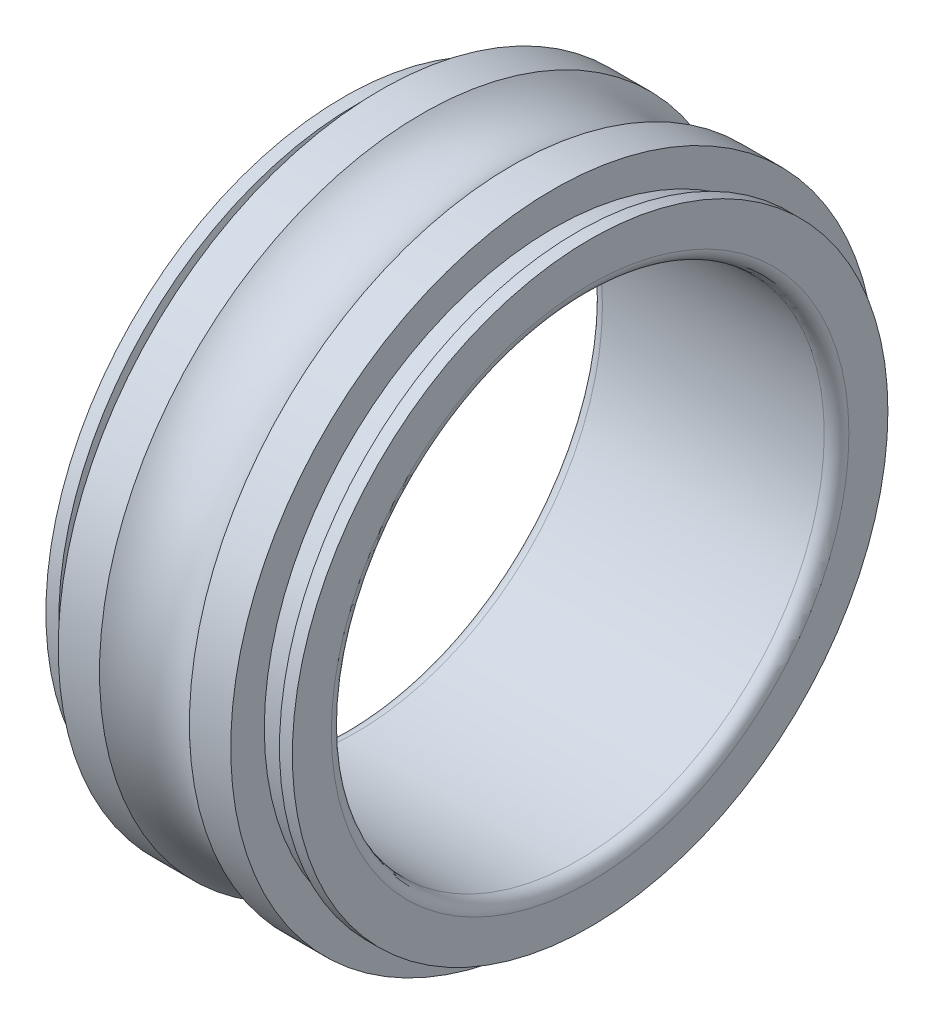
ISO-10303-21;
HEADER;
FILE_DESCRIPTION(('STEP AP214'),'2;1');
FILE_NAME('part.step','',(''),(''),'','','');
FILE_SCHEMA(('AUTOMOTIVE_DESIGN { 1 0 10303 214 1 1 1 1 }'));
ENDSEC;
DATA;
#1=APPLICATION_CONTEXT('core data for automotive mechanical design processes');
#2=APPLICATION_PROTOCOL_DEFINITION('international standard','automotive_design',2000,#1);
#3=PRODUCT_CONTEXT('',#1,'mechanical');
#4=PRODUCT('Part','Part','',(#3));
#5=PRODUCT_RELATED_PRODUCT_CATEGORY('part','',(#4));
#6=PRODUCT_DEFINITION_FORMATION('','',#4);
#7=PRODUCT_DEFINITION_CONTEXT('part definition',#1,'design');
#8=PRODUCT_DEFINITION('design','',#6,#7);
#9=PRODUCT_DEFINITION_SHAPE('','',#8);
#10=(LENGTH_UNIT() NAMED_UNIT(*) SI_UNIT(.MILLI.,.METRE.));
#11=(NAMED_UNIT(*) PLANE_ANGLE_UNIT() SI_UNIT($,.RADIAN.));
#12=(NAMED_UNIT(*) SI_UNIT($,.STERADIAN.) SOLID_ANGLE_UNIT());
#13=UNCERTAINTY_MEASURE_WITH_UNIT(LENGTH_MEASURE(1.E-05),#10,'distance_accuracy_value','');
#14=(GEOMETRIC_REPRESENTATION_CONTEXT(3) GLOBAL_UNCERTAINTY_ASSIGNED_CONTEXT((#13)) GLOBAL_UNIT_ASSIGNED_CONTEXT((#10,
#11,#12)) REPRESENTATION_CONTEXT('',''));
#15=CARTESIAN_POINT('',(0.,0.,0.));
#16=DIRECTION('',(0.,0.,1.));
#17=DIRECTION('',(1.,0.,0.));
#18=AXIS2_PLACEMENT_3D('',#15,#16,#17);
#19=CARTESIAN_POINT('',(0.,7.25,0.));
#20=DIRECTION('',(-1.,0.,0.));
#21=DIRECTION('',(0.,0.,1.));
#22=AXIS2_PLACEMENT_3D('',#19,#20,#21);
#23=PLANE('',#22);
#24=CARTESIAN_POINT('',(0.,0.,0.));
#25=DIRECTION('',(1.,0.,0.));
#26=DIRECTION('',(0.,0.,-1.));
#27=AXIS2_PLACEMENT_3D('',#24,#25,#26);
#28=CIRCLE('',#27,6.3);
#29=CARTESIAN_POINT('',(0.,0.,-6.3));
#30=VERTEX_POINT('',#29);
#31=EDGE_CURVE('E67',#30,#30,#28,.T.);
#32=ORIENTED_EDGE('',*,*,#31,.T.);
#33=EDGE_LOOP('',(#32));
#34=FACE_BOUND('',#33,.T.);
#35=CARTESIAN_POINT('',(0.,0.,0.));
#36=DIRECTION('',(1.,0.,0.));
#37=DIRECTION('',(0.,0.,-1.));
#38=AXIS2_PLACEMENT_3D('',#35,#36,#37);
#39=CIRCLE('',#38,7.25);
#40=CARTESIAN_POINT('',(0.,0.,-7.25));
#41=VERTEX_POINT('',#40);
#42=EDGE_CURVE('E64',#41,#41,#39,.T.);
#43=ORIENTED_EDGE('',*,*,#42,.F.);
#44=EDGE_LOOP('',(#43));
#45=FACE_BOUND('',#44,.T.);
#46=ADVANCED_FACE('F14',(#34,#45),#23,.T.);
#47=CARTESIAN_POINT('',(0.299999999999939,0.,0.));
#48=DIRECTION('',(1.,0.,0.));
#49=DIRECTION('',(0.,0.,-1.));
#50=AXIS2_PLACEMENT_3D('',#47,#48,#49);
#51=TOROIDAL_SURFACE('',#50,6.3,0.299999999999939);
#52=CARTESIAN_POINT('',(0.3,0.,0.));
#53=DIRECTION('',(1.,0.,0.));
#54=DIRECTION('',(0.,0.,-1.));
#55=AXIS2_PLACEMENT_3D('',#52,#53,#54);
#56=CIRCLE('',#55,6.);
#57=CARTESIAN_POINT('',(0.3,0.,-6.));
#58=VERTEX_POINT('',#57);
#59=EDGE_CURVE('E61',#58,#58,#56,.T.);
#60=ORIENTED_EDGE('',*,*,#59,.T.);
#61=EDGE_LOOP('',(#60));
#62=FACE_BOUND('',#61,.T.);
#63=ORIENTED_EDGE('',*,*,#31,.F.);
#64=EDGE_LOOP('',(#63));
#65=FACE_BOUND('',#64,.T.);
#66=ADVANCED_FACE('F73',(#62,#65),#51,.T.);
#67=CARTESIAN_POINT('',(6.,0.,0.));
#68=DIRECTION('',(1.,0.,0.));
#69=DIRECTION('',(0.,0.,-1.));
#70=AXIS2_PLACEMENT_3D('',#67,#68,#69);
#71=CYLINDRICAL_SURFACE('',#70,6.);
#72=CARTESIAN_POINT('',(5.7,0.,0.));
#73=DIRECTION('',(1.,0.,0.));
#74=DIRECTION('',(0.,0.,-1.));
#75=AXIS2_PLACEMENT_3D('',#72,#73,#74);
#76=CIRCLE('',#75,6.);
#77=CARTESIAN_POINT('',(5.7,0.,-6.));
#78=VERTEX_POINT('',#77);
#79=EDGE_CURVE('E58',#78,#78,#76,.T.);
#80=ORIENTED_EDGE('',*,*,#79,.T.);
#81=EDGE_LOOP('',(#80));
#82=FACE_BOUND('',#81,.T.);
#83=ORIENTED_EDGE('',*,*,#59,.F.);
#84=EDGE_LOOP('',(#83));
#85=FACE_BOUND('',#84,.T.);
#86=ADVANCED_FACE('F75',(#82,#85),#71,.F.);
#87=CARTESIAN_POINT('',(5.70000000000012,0.,0.));
#88=DIRECTION('',(1.,0.,0.));
#89=DIRECTION('',(0.,0.,-1.));
#90=AXIS2_PLACEMENT_3D('',#87,#88,#89);
#91=TOROIDAL_SURFACE('',#90,6.29999999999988,0.299999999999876);
#92=CARTESIAN_POINT('',(6.,0.,0.));
#93=DIRECTION('',(1.,0.,0.));
#94=DIRECTION('',(0.,0.,-1.));
#95=AXIS2_PLACEMENT_3D('',#92,#93,#94);
#96=CIRCLE('',#95,6.29999999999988);
#97=CARTESIAN_POINT('',(6.,0.,-6.29999999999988));
#98=VERTEX_POINT('',#97);
#99=EDGE_CURVE('E55',#98,#98,#96,.T.);
#100=ORIENTED_EDGE('',*,*,#99,.T.);
#101=EDGE_LOOP('',(#100));
#102=FACE_BOUND('',#101,.T.);
#103=ORIENTED_EDGE('',*,*,#79,.F.);
#104=EDGE_LOOP('',(#103));
#105=FACE_BOUND('',#104,.T.);
#106=ADVANCED_FACE('F83',(#102,#105),#91,.T.);
#107=CARTESIAN_POINT('',(6.,6.3,0.));
#108=DIRECTION('',(1.,0.,0.));
#109=DIRECTION('',(0.,0.,-1.));
#110=AXIS2_PLACEMENT_3D('',#107,#108,#109);
#111=PLANE('',#110);
#112=CARTESIAN_POINT('',(6.,0.,0.));
#113=DIRECTION('',(1.,0.,0.));
#114=DIRECTION('',(0.,0.,-1.));
#115=AXIS2_PLACEMENT_3D('',#112,#113,#114);
#116=CIRCLE('',#115,7.25);
#117=CARTESIAN_POINT('',(6.,0.,-7.25));
#118=VERTEX_POINT('',#117);
#119=EDGE_CURVE('E52',#118,#118,#116,.T.);
#120=ORIENTED_EDGE('',*,*,#119,.T.);
#121=EDGE_LOOP('',(#120));
#122=FACE_BOUND('',#121,.T.);
#123=ORIENTED_EDGE('',*,*,#99,.F.);
#124=EDGE_LOOP('',(#123));
#125=FACE_BOUND('',#124,.T.);
#126=ADVANCED_FACE('F90',(#122,#125),#111,.T.);
#127=CARTESIAN_POINT('',(6.,0.,0.));
#128=DIRECTION('',(1.,0.,0.));
#129=DIRECTION('',(0.,0.,-1.));
#130=AXIS2_PLACEMENT_3D('',#127,#128,#129);
#131=CYLINDRICAL_SURFACE('',#130,7.25);
#132=CARTESIAN_POINT('',(5.6868911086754,0.,0.));
#133=DIRECTION('',(1.,0.,0.));
#134=DIRECTION('',(0.,0.,-1.));
#135=AXIS2_PLACEMENT_3D('',#132,#133,#134);
#136=CIRCLE('',#135,7.25);
#137=CARTESIAN_POINT('',(5.6868911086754,0.,-7.25));
#138=VERTEX_POINT('',#137);
#139=EDGE_CURVE('E49',#138,#138,#136,.T.);
#140=ORIENTED_EDGE('',*,*,#139,.T.);
#141=EDGE_LOOP('',(#140));
#142=FACE_BOUND('',#141,.T.);
#143=ORIENTED_EDGE('',*,*,#119,.F.);
#144=EDGE_LOOP('',(#143));
#145=FACE_BOUND('',#144,.T.);
#146=ADVANCED_FACE('F94',(#142,#145),#131,.T.);
#147=CARTESIAN_POINT('',(5.6868911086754,0.,0.));
#148=DIRECTION('',(1.,0.,0.));
#149=DIRECTION('',(0.,0.,-1.));
#150=AXIS2_PLACEMENT_3D('',#147,#148,#149);
#151=CONICAL_SURFACE('',#150,7.25,1.30899693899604);
#152=CARTESIAN_POINT('',(5.6286121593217,0.,0.));
#153=DIRECTION('',(1.,0.,0.));
#154=DIRECTION('',(0.,0.,-1.));
#155=AXIS2_PLACEMENT_3D('',#152,#153,#154);
#156=CIRCLE('',#155,7.0325);
#157=CARTESIAN_POINT('',(5.6286121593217,0.,-7.0325));
#158=VERTEX_POINT('',#157);
#159=EDGE_CURVE('E46',#158,#158,#156,.T.);
#160=ORIENTED_EDGE('',*,*,#159,.T.);
#161=EDGE_LOOP('',(#160));
#162=FACE_BOUND('',#161,.T.);
#163=ORIENTED_EDGE('',*,*,#139,.F.);
#164=EDGE_LOOP('',(#163));
#165=FACE_BOUND('',#164,.T.);
#166=ADVANCED_FACE('F98',(#162,#165),#151,.T.);
#167=CARTESIAN_POINT('',(6.,0.,0.));
#168=DIRECTION('',(1.,0.,0.));
#169=DIRECTION('',(0.,0.,-1.));
#170=AXIS2_PLACEMENT_3D('',#167,#168,#169);
#171=CYLINDRICAL_SURFACE('',#170,7.0325);
#172=CARTESIAN_POINT('',(5.1,0.,0.));
#173=DIRECTION('',(1.,0.,0.));
#174=DIRECTION('',(0.,0.,-1.));
#175=AXIS2_PLACEMENT_3D('',#172,#173,#174);
#176=CIRCLE('',#175,7.0325);
#177=CARTESIAN_POINT('',(5.1,0.,-7.0325));
#178=VERTEX_POINT('',#177);
#179=EDGE_CURVE('E43',#178,#178,#176,.T.);
#180=ORIENTED_EDGE('',*,*,#179,.T.);
#181=EDGE_LOOP('',(#180));
#182=FACE_BOUND('',#181,.T.);
#183=ORIENTED_EDGE('',*,*,#159,.F.);
#184=EDGE_LOOP('',(#183));
#185=FACE_BOUND('',#184,.T.);
#186=ADVANCED_FACE('F102',(#182,#185),#171,.T.);
#187=CARTESIAN_POINT('',(5.1,7.0325,0.));
#188=DIRECTION('',(1.,0.,0.));
#189=DIRECTION('',(0.,0.,-1.));
#190=AXIS2_PLACEMENT_3D('',#187,#188,#189);
#191=PLANE('',#190);
#192=CARTESIAN_POINT('',(5.1,0.,0.));
#193=DIRECTION('',(1.,0.,0.));
#194=DIRECTION('',(0.,0.,-1.));
#195=AXIS2_PLACEMENT_3D('',#192,#193,#194);
#196=CIRCLE('',#195,7.85);
#197=CARTESIAN_POINT('',(5.1,0.,-7.85));
#198=VERTEX_POINT('',#197);
#199=EDGE_CURVE('E40',#198,#198,#196,.T.);
#200=ORIENTED_EDGE('',*,*,#199,.T.);
#201=EDGE_LOOP('',(#200));
#202=FACE_BOUND('',#201,.T.);
#203=ORIENTED_EDGE('',*,*,#179,.F.);
#204=EDGE_LOOP('',(#203));
#205=FACE_BOUND('',#204,.T.);
#206=ADVANCED_FACE('F106',(#202,#205),#191,.T.);
#207=CARTESIAN_POINT('',(6.,0.,0.));
#208=DIRECTION('',(1.,0.,0.));
#209=DIRECTION('',(0.,0.,-1.));
#210=AXIS2_PLACEMENT_3D('',#207,#208,#209);
#211=CYLINDRICAL_SURFACE('',#210,7.85);
#212=CARTESIAN_POINT('',(4.0943748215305,0.,0.));
#213=DIRECTION('',(1.,0.,0.));
#214=DIRECTION('',(0.,0.,-1.));
#215=AXIS2_PLACEMENT_3D('',#212,#213,#214);
#216=CIRCLE('',#215,7.85);
#217=CARTESIAN_POINT('',(4.0943748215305,0.,-7.85));
#218=VERTEX_POINT('',#217);
#219=EDGE_CURVE('E37',#218,#218,#216,.T.);
#220=ORIENTED_EDGE('',*,*,#219,.T.);
#221=EDGE_LOOP('',(#220));
#222=FACE_BOUND('',#221,.T.);
#223=ORIENTED_EDGE('',*,*,#199,.F.);
#224=EDGE_LOOP('',(#223));
#225=FACE_BOUND('',#224,.T.);
#226=ADVANCED_FACE('F110',(#222,#225),#211,.T.);
#227=CARTESIAN_POINT('',(3.,0.,0.));
#228=DIRECTION('',(1.,0.,0.));
#229=DIRECTION('',(0.,0.,-1.));
#230=AXIS2_PLACEMENT_3D('',#227,#228,#229);
#231=TOROIDAL_SURFACE('',#230,8.9999999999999,1.5874999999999);
#232=ORIENTED_EDGE('',*,*,#219,.F.);
#233=EDGE_LOOP('',(#232));
#234=FACE_BOUND('',#233,.T.);
#235=CARTESIAN_POINT('',(1.9056251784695,0.,0.));
#236=DIRECTION('',(1.,0.,0.));
#237=DIRECTION('',(0.,0.,-1.));
#238=AXIS2_PLACEMENT_3D('',#235,#236,#237);
#239=CIRCLE('',#238,7.85);
#240=CARTESIAN_POINT('',(1.9056251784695,0.,-7.85));
#241=VERTEX_POINT('',#240);
#242=EDGE_CURVE('E34',#241,#241,#239,.T.);
#243=ORIENTED_EDGE('',*,*,#242,.T.);
#244=EDGE_LOOP('',(#243));
#245=FACE_BOUND('',#244,.T.);
#246=ADVANCED_FACE('F114',(#234,#245),#231,.F.);
#247=CARTESIAN_POINT('',(6.,0.,0.));
#248=DIRECTION('',(1.,0.,0.));
#249=DIRECTION('',(0.,0.,-1.));
#250=AXIS2_PLACEMENT_3D('',#247,#248,#249);
#251=CYLINDRICAL_SURFACE('',#250,7.85);
#252=CARTESIAN_POINT('',(0.9,0.,0.));
#253=DIRECTION('',(1.,0.,0.));
#254=DIRECTION('',(0.,0.,-1.));
#255=AXIS2_PLACEMENT_3D('',#252,#253,#254);
#256=CIRCLE('',#255,7.85);
#257=CARTESIAN_POINT('',(0.9,0.,-7.85));
#258=VERTEX_POINT('',#257);
#259=EDGE_CURVE('E29',#258,#258,#256,.T.);
#260=ORIENTED_EDGE('',*,*,#259,.T.);
#261=EDGE_LOOP('',(#260));
#262=FACE_BOUND('',#261,.T.);
#263=ORIENTED_EDGE('',*,*,#242,.F.);
#264=EDGE_LOOP('',(#263));
#265=FACE_BOUND('',#264,.T.);
#266=ADVANCED_FACE('F118',(#262,#265),#251,.T.);
#267=CARTESIAN_POINT('',(0.9,7.85,0.));
#268=DIRECTION('',(-1.,0.,0.));
#269=DIRECTION('',(0.,0.,1.));
#270=AXIS2_PLACEMENT_3D('',#267,#268,#269);
#271=PLANE('',#270);
#272=CARTESIAN_POINT('',(0.9,0.,0.));
#273=DIRECTION('',(1.,0.,0.));
#274=DIRECTION('',(0.,0.,-1.));
#275=AXIS2_PLACEMENT_3D('',#272,#273,#274);
#276=CIRCLE('',#275,7.0325);
#277=CARTESIAN_POINT('',(0.9,0.,-7.0325));
#278=VERTEX_POINT('',#277);
#279=EDGE_CURVE('E25',#278,#278,#276,.T.);
#280=ORIENTED_EDGE('',*,*,#279,.T.);
#281=EDGE_LOOP('',(#280));
#282=FACE_BOUND('',#281,.T.);
#283=ORIENTED_EDGE('',*,*,#259,.F.);
#284=EDGE_LOOP('',(#283));
#285=FACE_BOUND('',#284,.T.);
#286=ADVANCED_FACE('F122',(#282,#285),#271,.T.);
#287=CARTESIAN_POINT('',(6.,0.,0.));
#288=DIRECTION('',(1.,0.,0.));
#289=DIRECTION('',(0.,0.,-1.));
#290=AXIS2_PLACEMENT_3D('',#287,#288,#289);
#291=CYLINDRICAL_SURFACE('',#290,7.0325);
#292=CARTESIAN_POINT('',(0.37138784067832,0.,0.));
#293=DIRECTION('',(1.,0.,0.));
#294=DIRECTION('',(0.,0.,-1.));
#295=AXIS2_PLACEMENT_3D('',#292,#293,#294);
#296=CIRCLE('',#295,7.0325);
#297=CARTESIAN_POINT('',(0.37138784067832,0.,-7.0325));
#298=VERTEX_POINT('',#297);
#299=EDGE_CURVE('E21',#298,#298,#296,.T.);
#300=ORIENTED_EDGE('',*,*,#299,.T.);
#301=EDGE_LOOP('',(#300));
#302=FACE_BOUND('',#301,.T.);
#303=ORIENTED_EDGE('',*,*,#279,.F.);
#304=EDGE_LOOP('',(#303));
#305=FACE_BOUND('',#304,.T.);
#306=ADVANCED_FACE('F126',(#302,#305),#291,.T.);
#307=CARTESIAN_POINT('',(0.371387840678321,0.,0.));
#308=DIRECTION('',(-1.,0.,0.));
#309=DIRECTION('',(0.,0.,1.));
#310=AXIS2_PLACEMENT_3D('',#307,#308,#309);
#311=CONICAL_SURFACE('',#310,7.0325,1.30899693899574);
#312=CARTESIAN_POINT('',(0.31310889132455,0.,0.));
#313=DIRECTION('',(1.,0.,0.));
#314=DIRECTION('',(0.,0.,-1.));
#315=AXIS2_PLACEMENT_3D('',#312,#313,#314);
#316=CIRCLE('',#315,7.25);
#317=CARTESIAN_POINT('',(0.31310889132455,0.,-7.25));
#318=VERTEX_POINT('',#317);
#319=EDGE_CURVE('E10',#318,#318,#316,.T.);
#320=ORIENTED_EDGE('',*,*,#319,.T.);
#321=EDGE_LOOP('',(#320));
#322=FACE_BOUND('',#321,.T.);
#323=ORIENTED_EDGE('',*,*,#299,.F.);
#324=EDGE_LOOP('',(#323));
#325=FACE_BOUND('',#324,.T.);
#326=ADVANCED_FACE('F129',(#322,#325),#311,.T.);
#327=CARTESIAN_POINT('',(6.,0.,0.));
#328=DIRECTION('',(1.,0.,0.));
#329=DIRECTION('',(0.,0.,-1.));
#330=AXIS2_PLACEMENT_3D('',#327,#328,#329);
#331=CYLINDRICAL_SURFACE('',#330,7.25);
#332=ORIENTED_EDGE('',*,*,#42,.T.);
#333=EDGE_LOOP('',(#332));
#334=FACE_BOUND('',#333,.T.);
#335=ORIENTED_EDGE('',*,*,#319,.F.);
#336=EDGE_LOOP('',(#335));
#337=FACE_BOUND('',#336,.T.);
#338=ADVANCED_FACE('F16',(#334,#337),#331,.T.);
#339=CLOSED_SHELL('',(#46,#66,#86,#106,#126,#146,#166,#186,#206,#226,#246,#266,#286,#306,#326,#338));
#340=MANIFOLD_SOLID_BREP('B1',#339);
#341=ADVANCED_BREP_SHAPE_REPRESENTATION('',(#18,#340),#14);
#342=SHAPE_DEFINITION_REPRESENTATION(#9,#341);
ENDSEC;
END-ISO-10303-21;
